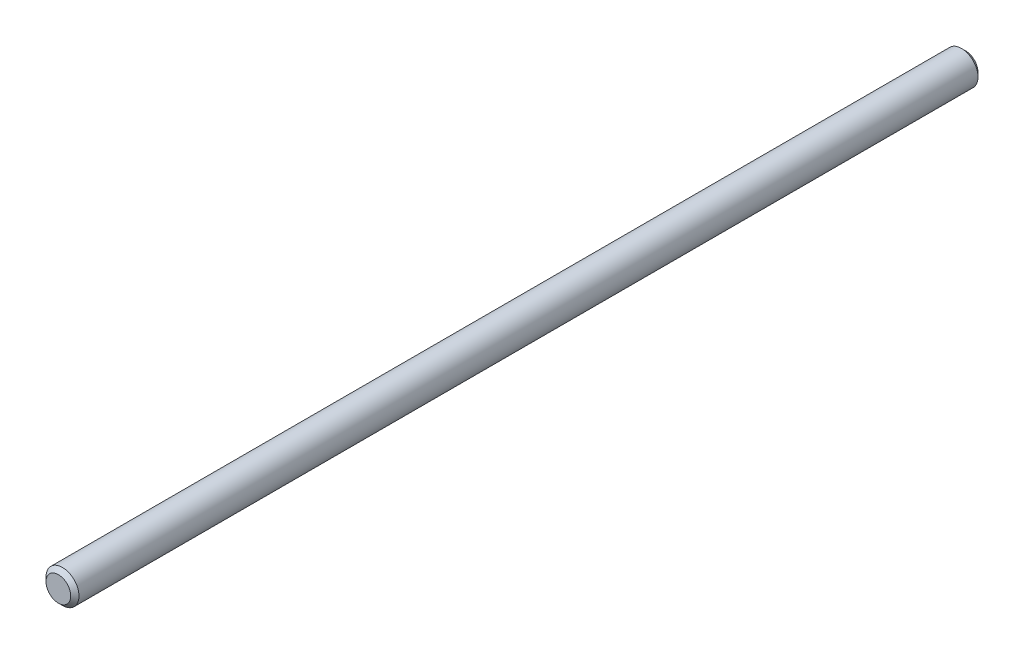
from build123d import *

# Parameters (mm, degrees)
SKETCH_1_R      = 2
EXTRUDE_1_DEPTH = 110
CHAMFER_1_SIZE  = 0.5


with BuildPart() as part:
    # Sketch 1 → Extrude 1 (new body)
    with BuildSketch(Plane.XY):
        Circle(SKETCH_1_R)
    extrude(amount=-EXTRUDE_1_DEPTH)

    # Chamfer 1
    chamfer_1_edges = [part.edges().sort_by_distance(p)[0] for p in [
        (-2, 0, 0),
        (-2, 0, -110),
    ]]
    chamfer(chamfer_1_edges, length=CHAMFER_1_SIZE)


solid = part.part
